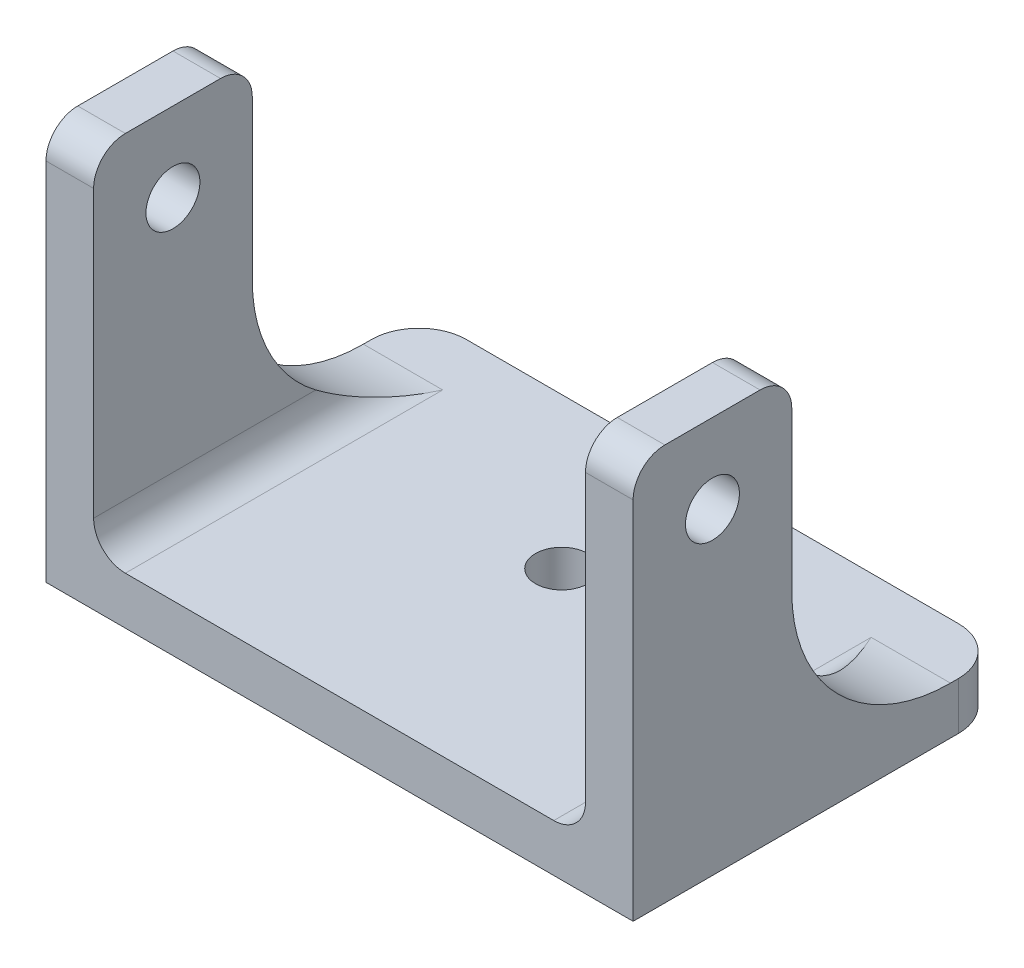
ISO-10303-21;
HEADER;
FILE_DESCRIPTION(('STEP AP214'),'2;1');
FILE_NAME('part.step','',(''),(''),'','','');
FILE_SCHEMA(('AUTOMOTIVE_DESIGN { 1 0 10303 214 1 1 1 1 }'));
ENDSEC;
DATA;
#1=APPLICATION_CONTEXT('core data for automotive mechanical design processes');
#2=APPLICATION_PROTOCOL_DEFINITION('international standard','automotive_design',2000,#1);
#3=PRODUCT_CONTEXT('',#1,'mechanical');
#4=PRODUCT('Part','Part','',(#3));
#5=PRODUCT_RELATED_PRODUCT_CATEGORY('part','',(#4));
#6=PRODUCT_DEFINITION_FORMATION('','',#4);
#7=PRODUCT_DEFINITION_CONTEXT('part definition',#1,'design');
#8=PRODUCT_DEFINITION('design','',#6,#7);
#9=PRODUCT_DEFINITION_SHAPE('','',#8);
#10=(LENGTH_UNIT() NAMED_UNIT(*) SI_UNIT(.MILLI.,.METRE.));
#11=(NAMED_UNIT(*) PLANE_ANGLE_UNIT() SI_UNIT($,.RADIAN.));
#12=(NAMED_UNIT(*) SI_UNIT($,.STERADIAN.) SOLID_ANGLE_UNIT());
#13=UNCERTAINTY_MEASURE_WITH_UNIT(LENGTH_MEASURE(1.E-05),#10,'distance_accuracy_value','');
#14=(GEOMETRIC_REPRESENTATION_CONTEXT(3) GLOBAL_UNCERTAINTY_ASSIGNED_CONTEXT((#13)) GLOBAL_UNIT_ASSIGNED_CONTEXT((#10,
#11,#12)) REPRESENTATION_CONTEXT('',''));
#15=CARTESIAN_POINT('',(0.,0.,0.));
#16=DIRECTION('',(0.,0.,1.));
#17=DIRECTION('',(1.,0.,0.));
#18=AXIS2_PLACEMENT_3D('',#15,#16,#17);
#19=CARTESIAN_POINT('',(0.,3.,0.));
#20=DIRECTION('',(0.,1.,0.));
#21=DIRECTION('',(0.,0.,1.));
#22=AXIS2_PLACEMENT_3D('',#19,#20,#21);
#23=PLANE('',#22);
#24=CARTESIAN_POINT('',(0.,3.,0.));
#25=DIRECTION('',(0.,1.,0.));
#26=DIRECTION('',(0.,0.,1.));
#27=AXIS2_PLACEMENT_3D('',#24,#25,#26);
#28=CIRCLE('',#27,1.65);
#29=CARTESIAN_POINT('',(0.,3.,-1.65));
#30=VERTEX_POINT('',#29);
#31=EDGE_CURVE('E412',#30,#30,#28,.F.);
#32=ORIENTED_EDGE('',*,*,#31,.T.);
#33=EDGE_LOOP('',(#32));
#34=FACE_BOUND('',#33,.T.);
#35=DIRECTION('',(-1.,0.,0.));
#36=VECTOR('',#35,1.);
#37=CARTESIAN_POINT('',(0.,3.,-6.));
#38=LINE('',#37,#36);
#39=CARTESIAN_POINT('',(-18.5,3.,-6.));
#40=VERTEX_POINT('',#39);
#41=CARTESIAN_POINT('',(-13.5,3.,-6.));
#42=VERTEX_POINT('',#41);
#43=EDGE_CURVE('E273',#40,#42,#38,.F.);
#44=ORIENTED_EDGE('',*,*,#43,.T.);
#45=DIRECTION('',(0.,0.,-1.));
#46=VECTOR('',#45,1.);
#47=CARTESIAN_POINT('',(-13.5,3.,0.));
#48=LINE('',#47,#46);
#49=CARTESIAN_POINT('',(-13.5,3.,14.));
#50=VERTEX_POINT('',#49);
#51=EDGE_CURVE('E294',#42,#50,#48,.F.);
#52=ORIENTED_EDGE('',*,*,#51,.T.);
#53=DIRECTION('',(1.,0.,0.));
#54=VECTOR('',#53,1.);
#55=CARTESIAN_POINT('',(-18.5,3.,14.));
#56=LINE('',#55,#54);
#57=CARTESIAN_POINT('',(13.5,3.,14.));
#58=VERTEX_POINT('',#57);
#59=EDGE_CURVE('E421',#50,#58,#56,.T.);
#60=ORIENTED_EDGE('',*,*,#59,.T.);
#61=DIRECTION('',(0.,0.,1.));
#62=VECTOR('',#61,1.);
#63=CARTESIAN_POINT('',(13.5,3.,0.));
#64=LINE('',#63,#62);
#65=CARTESIAN_POINT('',(13.5,3.,-6.));
#66=VERTEX_POINT('',#65);
#67=EDGE_CURVE('E291',#58,#66,#64,.F.);
#68=ORIENTED_EDGE('',*,*,#67,.T.);
#69=DIRECTION('',(-1.,0.,0.));
#70=VECTOR('',#69,1.);
#71=CARTESIAN_POINT('',(0.,3.,-6.));
#72=LINE('',#71,#70);
#73=CARTESIAN_POINT('',(18.5,3.,-6.));
#74=VERTEX_POINT('',#73);
#75=EDGE_CURVE('E275',#66,#74,#72,.F.);
#76=ORIENTED_EDGE('',*,*,#75,.T.);
#77=DIRECTION('',(0.,0.,-1.));
#78=VECTOR('',#77,1.);
#79=CARTESIAN_POINT('',(18.5,3.,-9.5));
#80=LINE('',#79,#78);
#81=CARTESIAN_POINT('',(18.5,3.,-6.5));
#82=VERTEX_POINT('',#81);
#83=EDGE_CURVE('E385',#74,#82,#80,.T.);
#84=ORIENTED_EDGE('',*,*,#83,.T.);
#85=CARTESIAN_POINT('',(15.5,3.,-6.5));
#86=DIRECTION('',(0.,1.,0.));
#87=DIRECTION('',(0.,0.,1.));
#88=AXIS2_PLACEMENT_3D('',#85,#86,#87);
#89=CIRCLE('',#88,3.);
#90=CARTESIAN_POINT('',(15.5,3.,-9.5));
#91=VERTEX_POINT('',#90);
#92=EDGE_CURVE('E223',#82,#91,#89,.T.);
#93=ORIENTED_EDGE('',*,*,#92,.T.);
#94=DIRECTION('',(-1.,0.,0.));
#95=VECTOR('',#94,1.);
#96=CARTESIAN_POINT('',(-18.5,3.,-9.5));
#97=LINE('',#96,#95);
#98=CARTESIAN_POINT('',(-15.5,3.,-9.5));
#99=VERTEX_POINT('',#98);
#100=EDGE_CURVE('E209',#91,#99,#97,.T.);
#101=ORIENTED_EDGE('',*,*,#100,.T.);
#102=CARTESIAN_POINT('',(-15.5,3.,-6.5));
#103=DIRECTION('',(0.,1.,0.));
#104=DIRECTION('',(0.,0.,1.));
#105=AXIS2_PLACEMENT_3D('',#102,#103,#104);
#106=CIRCLE('',#105,3.);
#107=CARTESIAN_POINT('',(-18.5,3.,-6.5));
#108=VERTEX_POINT('',#107);
#109=EDGE_CURVE('E225',#99,#108,#106,.T.);
#110=ORIENTED_EDGE('',*,*,#109,.T.);
#111=DIRECTION('',(0.,0.,1.));
#112=VECTOR('',#111,1.);
#113=CARTESIAN_POINT('',(-18.5,3.,-9.5));
#114=LINE('',#113,#112);
#115=EDGE_CURVE('E208',#108,#40,#114,.T.);
#116=ORIENTED_EDGE('',*,*,#115,.T.);
#117=EDGE_LOOP('',(#44,#52,#60,#68,#76,#84,#93,#101,#110,#116));
#118=FACE_BOUND('',#117,.T.);
#119=ADVANCED_FACE('F32',(#34,#118),#23,.T.);
#120=CARTESIAN_POINT('',(-18.5,3.,-9.5));
#121=DIRECTION('',(1.,0.,0.));
#122=DIRECTION('',(0.,0.,-1.));
#123=AXIS2_PLACEMENT_3D('',#120,#121,#122);
#124=PLANE('',#123);
#125=CARTESIAN_POINT('',(-18.5,20.,9.));
#126=DIRECTION('',(-1.,0.,0.));
#127=DIRECTION('',(0.,0.,1.));
#128=AXIS2_PLACEMENT_3D('',#125,#126,#127);
#129=CIRCLE('',#128,1.7);
#130=CARTESIAN_POINT('',(-18.5,20.,10.7));
#131=VERTEX_POINT('',#130);
#132=EDGE_CURVE('E451',#131,#131,#129,.T.);
#133=ORIENTED_EDGE('',*,*,#132,.F.);
#134=EDGE_LOOP('',(#133));
#135=FACE_BOUND('',#134,.T.);
#136=DIRECTION('',(0.,0.,1.));
#137=VECTOR('',#136,1.);
#138=CARTESIAN_POINT('',(-18.5,25.,14.));
#139=LINE('',#138,#137);
#140=CARTESIAN_POINT('',(-18.5,25.,6.));
#141=VERTEX_POINT('',#140);
#142=CARTESIAN_POINT('',(-18.5,25.,12.));
#143=VERTEX_POINT('',#142);
#144=EDGE_CURVE('E391',#141,#143,#139,.T.);
#145=ORIENTED_EDGE('',*,*,#144,.F.);
#146=CARTESIAN_POINT('',(-18.5,23.,6.));
#147=DIRECTION('',(1.,0.,0.));
#148=DIRECTION('',(0.,0.,-1.));
#149=AXIS2_PLACEMENT_3D('',#146,#147,#148);
#150=CIRCLE('',#149,2.);
#151=CARTESIAN_POINT('',(-18.5,23.,4.));
#152=VERTEX_POINT('',#151);
#153=EDGE_CURVE('E262',#141,#152,#150,.F.);
#154=ORIENTED_EDGE('',*,*,#153,.T.);
#155=DIRECTION('',(0.,-1.,0.));
#156=VECTOR('',#155,1.);
#157=CARTESIAN_POINT('',(-18.5,25.,4.));
#158=LINE('',#157,#156);
#159=CARTESIAN_POINT('',(-18.5,13.,4.));
#160=VERTEX_POINT('',#159);
#161=EDGE_CURVE('E403',#152,#160,#158,.T.);
#162=ORIENTED_EDGE('',*,*,#161,.T.);
#163=CARTESIAN_POINT('',(-18.5,13.,-6.));
#164=DIRECTION('',(1.,0.,0.));
#165=DIRECTION('',(0.,0.,-1.));
#166=AXIS2_PLACEMENT_3D('',#163,#164,#165);
#167=CIRCLE('',#166,10.);
#168=EDGE_CURVE('E284',#160,#40,#167,.T.);
#169=ORIENTED_EDGE('',*,*,#168,.T.);
#170=ORIENTED_EDGE('',*,*,#115,.F.);
#171=DIRECTION('',(0.,-1.,0.));
#172=VECTOR('',#171,1.);
#173=CARTESIAN_POINT('',(-18.5,3.,-6.5));
#174=LINE('',#173,#172);
#175=CARTESIAN_POINT('',(-18.5,0.,-6.5));
#176=VERTEX_POINT('',#175);
#177=EDGE_CURVE('E194',#108,#176,#174,.T.);
#178=ORIENTED_EDGE('',*,*,#177,.T.);
#179=DIRECTION('',(0.,0.,1.));
#180=VECTOR('',#179,1.);
#181=CARTESIAN_POINT('',(-18.5,0.,-9.5));
#182=LINE('',#181,#180);
#183=CARTESIAN_POINT('',(-18.5,0.,14.));
#184=VERTEX_POINT('',#183);
#185=EDGE_CURVE('E189',#176,#184,#182,.T.);
#186=ORIENTED_EDGE('',*,*,#185,.T.);
#187=DIRECTION('',(0.,-1.,0.));
#188=VECTOR('',#187,1.);
#189=CARTESIAN_POINT('',(-18.5,3.,14.));
#190=LINE('',#189,#188);
#191=CARTESIAN_POINT('',(-18.5,23.,14.));
#192=VERTEX_POINT('',#191);
#193=EDGE_CURVE('E172',#192,#184,#190,.T.);
#194=ORIENTED_EDGE('',*,*,#193,.F.);
#195=CARTESIAN_POINT('',(-18.5,23.,12.));
#196=DIRECTION('',(1.,0.,0.));
#197=DIRECTION('',(0.,0.,-1.));
#198=AXIS2_PLACEMENT_3D('',#195,#196,#197);
#199=CIRCLE('',#198,2.);
#200=EDGE_CURVE('E260',#192,#143,#199,.F.);
#201=ORIENTED_EDGE('',*,*,#200,.T.);
#202=EDGE_LOOP('',(#145,#154,#162,#169,#170,#178,#186,#194,#201));
#203=FACE_BOUND('',#202,.T.);
#204=ADVANCED_FACE('F191',(#135,#203),#124,.F.);
#205=CARTESIAN_POINT('',(-18.5,3.,14.));
#206=DIRECTION('',(0.,0.,-1.));
#207=DIRECTION('',(-1.,0.,0.));
#208=AXIS2_PLACEMENT_3D('',#205,#206,#207);
#209=PLANE('',#208);
#210=DIRECTION('',(0.,-1.,0.));
#211=VECTOR('',#210,1.);
#212=CARTESIAN_POINT('',(18.5,3.,14.));
#213=LINE('',#212,#211);
#214=CARTESIAN_POINT('',(18.5,23.,14.));
#215=VERTEX_POINT('',#214);
#216=CARTESIAN_POINT('',(18.5,0.,14.));
#217=VERTEX_POINT('',#216);
#218=EDGE_CURVE('E185',#215,#217,#213,.T.);
#219=ORIENTED_EDGE('',*,*,#218,.F.);
#220=DIRECTION('',(1.,0.,0.));
#221=VECTOR('',#220,1.);
#222=CARTESIAN_POINT('',(15.5,23.,14.));
#223=LINE('',#222,#221);
#224=CARTESIAN_POINT('',(15.5,23.,14.));
#225=VERTEX_POINT('',#224);
#226=EDGE_CURVE('E246',#215,#225,#223,.F.);
#227=ORIENTED_EDGE('',*,*,#226,.T.);
#228=DIRECTION('',(0.,-1.,0.));
#229=VECTOR('',#228,1.);
#230=CARTESIAN_POINT('',(15.5,25.,14.));
#231=LINE('',#230,#229);
#232=CARTESIAN_POINT('',(15.5,5.,14.));
#233=VERTEX_POINT('',#232);
#234=EDGE_CURVE('E397',#225,#233,#231,.T.);
#235=ORIENTED_EDGE('',*,*,#234,.T.);
#236=CARTESIAN_POINT('',(13.5,5.,14.));
#237=DIRECTION('',(0.,0.,-1.));
#238=DIRECTION('',(-1.,0.,0.));
#239=AXIS2_PLACEMENT_3D('',#236,#237,#238);
#240=CIRCLE('',#239,2.);
#241=EDGE_CURVE('E45',#233,#58,#240,.T.);
#242=ORIENTED_EDGE('',*,*,#241,.T.);
#243=ORIENTED_EDGE('',*,*,#59,.F.);
#244=CARTESIAN_POINT('',(-13.5,5.,14.));
#245=DIRECTION('',(0.,0.,-1.));
#246=DIRECTION('',(-1.,0.,0.));
#247=AXIS2_PLACEMENT_3D('',#244,#245,#246);
#248=CIRCLE('',#247,2.);
#249=CARTESIAN_POINT('',(-15.5,5.,14.));
#250=VERTEX_POINT('',#249);
#251=EDGE_CURVE('E305',#50,#250,#248,.T.);
#252=ORIENTED_EDGE('',*,*,#251,.T.);
#253=DIRECTION('',(0.,-1.,0.));
#254=VECTOR('',#253,1.);
#255=CARTESIAN_POINT('',(-15.5,25.,14.));
#256=LINE('',#255,#254);
#257=CARTESIAN_POINT('',(-15.5,23.,14.));
#258=VERTEX_POINT('',#257);
#259=EDGE_CURVE('E409',#258,#250,#256,.T.);
#260=ORIENTED_EDGE('',*,*,#259,.F.);
#261=DIRECTION('',(1.,0.,0.));
#262=VECTOR('',#261,1.);
#263=CARTESIAN_POINT('',(-18.5,23.,14.));
#264=LINE('',#263,#262);
#265=EDGE_CURVE('E181',#258,#192,#264,.F.);
#266=ORIENTED_EDGE('',*,*,#265,.T.);
#267=ORIENTED_EDGE('',*,*,#193,.T.);
#268=DIRECTION('',(1.,0.,0.));
#269=VECTOR('',#268,1.);
#270=CARTESIAN_POINT('',(-18.5,0.,14.));
#271=LINE('',#270,#269);
#272=EDGE_CURVE('E177',#184,#217,#271,.T.);
#273=ORIENTED_EDGE('',*,*,#272,.T.);
#274=EDGE_LOOP('',(#219,#227,#235,#242,#243,#252,#260,#266,#267,#273));
#275=FACE_BOUND('',#274,.T.);
#276=ADVANCED_FACE('F175',(#275),#209,.F.);
#277=CARTESIAN_POINT('',(18.5,3.,-9.5));
#278=DIRECTION('',(-1.,0.,0.));
#279=DIRECTION('',(0.,0.,1.));
#280=AXIS2_PLACEMENT_3D('',#277,#278,#279);
#281=PLANE('',#280);
#282=CARTESIAN_POINT('',(18.5,20.,9.));
#283=DIRECTION('',(-1.,0.,0.));
#284=DIRECTION('',(0.,0.,1.));
#285=AXIS2_PLACEMENT_3D('',#282,#283,#284);
#286=CIRCLE('',#285,1.7);
#287=CARTESIAN_POINT('',(18.5,20.,10.7));
#288=VERTEX_POINT('',#287);
#289=EDGE_CURVE('E235',#288,#288,#286,.T.);
#290=ORIENTED_EDGE('',*,*,#289,.T.);
#291=EDGE_LOOP('',(#290));
#292=FACE_BOUND('',#291,.T.);
#293=DIRECTION('',(0.,0.,-1.));
#294=VECTOR('',#293,1.);
#295=CARTESIAN_POINT('',(18.5,25.,14.));
#296=LINE('',#295,#294);
#297=CARTESIAN_POINT('',(18.5,25.,12.));
#298=VERTEX_POINT('',#297);
#299=CARTESIAN_POINT('',(18.5,25.,6.));
#300=VERTEX_POINT('',#299);
#301=EDGE_CURVE('E445',#298,#300,#296,.T.);
#302=ORIENTED_EDGE('',*,*,#301,.F.);
#303=CARTESIAN_POINT('',(18.5,23.,12.));
#304=DIRECTION('',(-1.,0.,0.));
#305=DIRECTION('',(0.,0.,1.));
#306=AXIS2_PLACEMENT_3D('',#303,#304,#305);
#307=CIRCLE('',#306,2.);
#308=EDGE_CURVE('E243',#298,#215,#307,.F.);
#309=ORIENTED_EDGE('',*,*,#308,.T.);
#310=ORIENTED_EDGE('',*,*,#218,.T.);
#311=DIRECTION('',(0.,0.,-1.));
#312=VECTOR('',#311,1.);
#313=CARTESIAN_POINT('',(18.5,0.,-9.5));
#314=LINE('',#313,#312);
#315=CARTESIAN_POINT('',(18.5,0.,-6.5));
#316=VERTEX_POINT('',#315);
#317=EDGE_CURVE('E200',#217,#316,#314,.T.);
#318=ORIENTED_EDGE('',*,*,#317,.T.);
#319=DIRECTION('',(0.,-1.,0.));
#320=VECTOR('',#319,1.);
#321=CARTESIAN_POINT('',(18.5,3.,-6.5));
#322=LINE('',#321,#320);
#323=EDGE_CURVE('E227',#316,#82,#322,.F.);
#324=ORIENTED_EDGE('',*,*,#323,.T.);
#325=ORIENTED_EDGE('',*,*,#83,.F.);
#326=CARTESIAN_POINT('',(18.5,13.,-6.));
#327=DIRECTION('',(-1.,0.,0.));
#328=DIRECTION('',(0.,0.,1.));
#329=AXIS2_PLACEMENT_3D('',#326,#327,#328);
#330=CIRCLE('',#329,10.);
#331=CARTESIAN_POINT('',(18.5,13.,4.));
#332=VERTEX_POINT('',#331);
#333=EDGE_CURVE('E282',#74,#332,#330,.T.);
#334=ORIENTED_EDGE('',*,*,#333,.T.);
#335=DIRECTION('',(0.,-1.,0.));
#336=VECTOR('',#335,1.);
#337=CARTESIAN_POINT('',(18.5,25.,4.));
#338=LINE('',#337,#336);
#339=CARTESIAN_POINT('',(18.5,23.,4.));
#340=VERTEX_POINT('',#339);
#341=EDGE_CURVE('E383',#340,#332,#338,.T.);
#342=ORIENTED_EDGE('',*,*,#341,.F.);
#343=CARTESIAN_POINT('',(18.5,23.,6.));
#344=DIRECTION('',(-1.,0.,0.));
#345=DIRECTION('',(0.,0.,1.));
#346=AXIS2_PLACEMENT_3D('',#343,#344,#345);
#347=CIRCLE('',#346,2.);
#348=EDGE_CURVE('E241',#340,#300,#347,.F.);
#349=ORIENTED_EDGE('',*,*,#348,.T.);
#350=EDGE_LOOP('',(#302,#309,#310,#318,#324,#325,#334,#342,#349));
#351=FACE_BOUND('',#350,.T.);
#352=ADVANCED_FACE('F339',(#292,#351),#281,.F.);
#353=CARTESIAN_POINT('',(-18.5,3.,-9.5));
#354=DIRECTION('',(0.,0.,1.));
#355=DIRECTION('',(1.,0.,0.));
#356=AXIS2_PLACEMENT_3D('',#353,#354,#355);
#357=PLANE('',#356);
#358=DIRECTION('',(-1.,0.,0.));
#359=VECTOR('',#358,1.);
#360=CARTESIAN_POINT('',(-18.5,0.,-9.5));
#361=LINE('',#360,#359);
#362=CARTESIAN_POINT('',(15.5,0.,-9.5));
#363=VERTEX_POINT('',#362);
#364=CARTESIAN_POINT('',(-15.5,0.,-9.5));
#365=VERTEX_POINT('',#364);
#366=EDGE_CURVE('E202',#363,#365,#361,.T.);
#367=ORIENTED_EDGE('',*,*,#366,.T.);
#368=DIRECTION('',(0.,-1.,0.));
#369=VECTOR('',#368,1.);
#370=CARTESIAN_POINT('',(-15.5,3.,-9.5));
#371=LINE('',#370,#369);
#372=EDGE_CURVE('E221',#365,#99,#371,.F.);
#373=ORIENTED_EDGE('',*,*,#372,.T.);
#374=ORIENTED_EDGE('',*,*,#100,.F.);
#375=DIRECTION('',(0.,-1.,0.));
#376=VECTOR('',#375,1.);
#377=CARTESIAN_POINT('',(15.5,3.,-9.5));
#378=LINE('',#377,#376);
#379=EDGE_CURVE('E218',#91,#363,#378,.T.);
#380=ORIENTED_EDGE('',*,*,#379,.T.);
#381=EDGE_LOOP('',(#367,#373,#374,#380));
#382=FACE_BOUND('',#381,.T.);
#383=ADVANCED_FACE('F335',(#382),#357,.F.);
#384=CARTESIAN_POINT('',(0.,0.,0.));
#385=DIRECTION('',(0.,1.,0.));
#386=DIRECTION('',(0.,0.,1.));
#387=AXIS2_PLACEMENT_3D('',#384,#385,#386);
#388=PLANE('',#387);
#389=CARTESIAN_POINT('',(0.,0.,0.));
#390=DIRECTION('',(0.,1.,0.));
#391=DIRECTION('',(0.,0.,1.));
#392=AXIS2_PLACEMENT_3D('',#389,#390,#391);
#393=CIRCLE('',#392,7.);
#394=CARTESIAN_POINT('',(0.,0.,7.));
#395=VERTEX_POINT('',#394);
#396=EDGE_CURVE('E184',#395,#395,#393,.F.);
#397=ORIENTED_EDGE('',*,*,#396,.F.);
#398=EDGE_LOOP('',(#397));
#399=FACE_BOUND('',#398,.T.);
#400=ORIENTED_EDGE('',*,*,#185,.F.);
#401=CARTESIAN_POINT('',(-15.5,0.,-6.5));
#402=DIRECTION('',(0.,1.,0.));
#403=DIRECTION('',(0.,0.,1.));
#404=AXIS2_PLACEMENT_3D('',#401,#402,#403);
#405=CIRCLE('',#404,3.);
#406=EDGE_CURVE('E216',#176,#365,#405,.F.);
#407=ORIENTED_EDGE('',*,*,#406,.T.);
#408=ORIENTED_EDGE('',*,*,#366,.F.);
#409=CARTESIAN_POINT('',(15.5,0.,-6.5));
#410=DIRECTION('',(0.,1.,0.));
#411=DIRECTION('',(0.,0.,1.));
#412=AXIS2_PLACEMENT_3D('',#409,#410,#411);
#413=CIRCLE('',#412,3.);
#414=EDGE_CURVE('E214',#363,#316,#413,.F.);
#415=ORIENTED_EDGE('',*,*,#414,.T.);
#416=ORIENTED_EDGE('',*,*,#317,.F.);
#417=ORIENTED_EDGE('',*,*,#272,.F.);
#418=EDGE_LOOP('',(#400,#407,#408,#415,#416,#417));
#419=FACE_BOUND('',#418,.T.);
#420=ADVANCED_FACE('F198',(#399,#419),#388,.F.);
#421=CARTESIAN_POINT('',(0.,-3.,0.));
#422=DIRECTION('',(0.,1.,0.));
#423=DIRECTION('',(0.,0.,1.));
#424=AXIS2_PLACEMENT_3D('',#421,#422,#423);
#425=CYLINDRICAL_SURFACE('',#424,7.);
#426=CARTESIAN_POINT('',(0.,-3.,0.));
#427=DIRECTION('',(0.,-1.,0.));
#428=DIRECTION('',(0.,0.,-1.));
#429=AXIS2_PLACEMENT_3D('',#426,#427,#428);
#430=CIRCLE('',#429,7.);
#431=CARTESIAN_POINT('',(0.,-3.,-7.));
#432=VERTEX_POINT('',#431);
#433=EDGE_CURVE('E196',#432,#432,#430,.T.);
#434=ORIENTED_EDGE('',*,*,#433,.F.);
#435=EDGE_LOOP('',(#434));
#436=FACE_BOUND('',#435,.T.);
#437=ORIENTED_EDGE('',*,*,#396,.T.);
#438=EDGE_LOOP('',(#437));
#439=FACE_BOUND('',#438,.T.);
#440=ADVANCED_FACE('F331',(#436,#439),#425,.T.);
#441=CARTESIAN_POINT('',(0.,-3.,0.));
#442=DIRECTION('',(0.,-1.,0.));
#443=DIRECTION('',(0.,0.,-1.));
#444=AXIS2_PLACEMENT_3D('',#441,#442,#443);
#445=PLANE('',#444);
#446=CARTESIAN_POINT('',(0.,-3.,0.));
#447=DIRECTION('',(0.,-1.,0.));
#448=DIRECTION('',(0.,0.,-1.));
#449=AXIS2_PLACEMENT_3D('',#446,#447,#448);
#450=CIRCLE('',#449,1.65);
#451=CARTESIAN_POINT('',(0.,-3.,-1.65));
#452=VERTEX_POINT('',#451);
#453=EDGE_CURVE('E413',#452,#452,#450,.T.);
#454=ORIENTED_EDGE('',*,*,#453,.F.);
#455=EDGE_LOOP('',(#454));
#456=FACE_BOUND('',#455,.T.);
#457=ORIENTED_EDGE('',*,*,#433,.T.);
#458=EDGE_LOOP('',(#457));
#459=FACE_BOUND('',#458,.T.);
#460=ADVANCED_FACE('F485',(#456,#459),#445,.T.);
#461=CARTESIAN_POINT('',(0.,3.001,0.));
#462=DIRECTION('',(0.,-1.,0.));
#463=DIRECTION('',(0.,0.,-1.));
#464=AXIS2_PLACEMENT_3D('',#461,#462,#463);
#465=CYLINDRICAL_SURFACE('',#464,1.65);
#466=CARTESIAN_POINT('',(0.,3.,-1.65));
#467=CARTESIAN_POINT('',(0.,2.9375,-1.65));
#468=CARTESIAN_POINT('',(0.,2.875,-1.65));
#469=CARTESIAN_POINT('',(0.,2.75,-1.65));
#470=CARTESIAN_POINT('',(0.,2.6875,-1.65));
#471=CARTESIAN_POINT('',(0.,2.5625,-1.65));
#472=CARTESIAN_POINT('',(0.,2.5,-1.65));
#473=CARTESIAN_POINT('',(0.,2.375,-1.65));
#474=CARTESIAN_POINT('',(0.,2.3125,-1.65));
#475=CARTESIAN_POINT('',(0.,2.1875,-1.65));
#476=CARTESIAN_POINT('',(0.,2.125,-1.65));
#477=CARTESIAN_POINT('',(0.,2.,-1.65));
#478=CARTESIAN_POINT('',(0.,1.9375,-1.65));
#479=CARTESIAN_POINT('',(0.,1.8125,-1.65));
#480=CARTESIAN_POINT('',(0.,1.75,-1.65));
#481=CARTESIAN_POINT('',(0.,1.625,-1.65));
#482=CARTESIAN_POINT('',(0.,1.5625,-1.65));
#483=CARTESIAN_POINT('',(0.,1.4375,-1.65));
#484=CARTESIAN_POINT('',(0.,1.375,-1.65));
#485=CARTESIAN_POINT('',(0.,1.25,-1.65));
#486=CARTESIAN_POINT('',(0.,1.1875,-1.65));
#487=CARTESIAN_POINT('',(0.,1.0625,-1.65));
#488=CARTESIAN_POINT('',(0.,1.,-1.65));
#489=CARTESIAN_POINT('',(0.,0.875,-1.65));
#490=CARTESIAN_POINT('',(0.,0.8125,-1.65));
#491=CARTESIAN_POINT('',(0.,0.6875,-1.65));
#492=CARTESIAN_POINT('',(0.,0.625,-1.65));
#493=CARTESIAN_POINT('',(0.,0.5,-1.65));
#494=CARTESIAN_POINT('',(0.,0.4375,-1.65));
#495=CARTESIAN_POINT('',(0.,0.3125,-1.65));
#496=CARTESIAN_POINT('',(0.,0.25,-1.65));
#497=CARTESIAN_POINT('',(0.,0.125,-1.65));
#498=CARTESIAN_POINT('',(0.,0.0624999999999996,-1.65));
#499=CARTESIAN_POINT('',(0.,-0.0625000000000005,-1.65));
#500=CARTESIAN_POINT('',(0.,-0.125000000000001,-1.65));
#501=CARTESIAN_POINT('',(0.,-0.250000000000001,-1.65));
#502=CARTESIAN_POINT('',(0.,-0.3125,-1.65));
#503=CARTESIAN_POINT('',(0.,-0.4375,-1.65));
#504=CARTESIAN_POINT('',(0.,-0.5,-1.65));
#505=CARTESIAN_POINT('',(0.,-0.625000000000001,-1.65));
#506=CARTESIAN_POINT('',(0.,-0.687500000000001,-1.65));
#507=CARTESIAN_POINT('',(0.,-0.8125,-1.65));
#508=CARTESIAN_POINT('',(0.,-0.875,-1.65));
#509=CARTESIAN_POINT('',(0.,-1.,-1.65));
#510=CARTESIAN_POINT('',(0.,-1.0625,-1.65));
#511=CARTESIAN_POINT('',(0.,-1.1875,-1.65));
#512=CARTESIAN_POINT('',(0.,-1.25,-1.65));
#513=CARTESIAN_POINT('',(0.,-1.375,-1.65));
#514=CARTESIAN_POINT('',(0.,-1.4375,-1.65));
#515=CARTESIAN_POINT('',(0.,-1.5625,-1.65));
#516=CARTESIAN_POINT('',(0.,-1.625,-1.65));
#517=CARTESIAN_POINT('',(0.,-1.75,-1.65));
#518=CARTESIAN_POINT('',(0.,-1.8125,-1.65));
#519=CARTESIAN_POINT('',(0.,-1.9375,-1.65));
#520=CARTESIAN_POINT('',(0.,-2.,-1.65));
#521=CARTESIAN_POINT('',(0.,-2.125,-1.65));
#522=CARTESIAN_POINT('',(0.,-2.1875,-1.65));
#523=CARTESIAN_POINT('',(0.,-2.3125,-1.65));
#524=CARTESIAN_POINT('',(0.,-2.375,-1.65));
#525=CARTESIAN_POINT('',(0.,-2.5,-1.65));
#526=CARTESIAN_POINT('',(0.,-2.5625,-1.65));
#527=CARTESIAN_POINT('',(0.,-2.6875,-1.65));
#528=CARTESIAN_POINT('',(0.,-2.75,-1.65));
#529=CARTESIAN_POINT('',(0.,-2.875,-1.65));
#530=CARTESIAN_POINT('',(0.,-2.9375,-1.65));
#531=CARTESIAN_POINT('',(0.,-3.,-1.65));
#532=B_SPLINE_CURVE_WITH_KNOTS('',3,(#466,#467,#468,#469,#470,#471,#472,#473,#474,#475,#476,
#477,#478,#479,#480,#481,#482,#483,#484,#485,#486,#487,#488,#489,#490,#491,#492,#493,#494,#495,
#496,#497,#498,#499,#500,#501,#502,#503,#504,#505,#506,#507,#508,#509,#510,#511,#512,#513,#514,
#515,#516,#517,#518,#519,#520,#521,#522,#523,#524,#525,#526,#527,#528,#529,#530,#531),
.UNSPECIFIED.,.F.,.F.,(4,2,2,2,2,2,2,2,2,2,2,2,2,2,2,2,2,2,2,2,2,2,2,2,2,2,2,2,2,2,2,2,4),(0.,
0.1875,0.375,0.5625,0.75,0.9375,1.125,1.3125,1.5,1.6875,1.875,2.0625,2.25,2.4375,2.625,2.8125,
3.,3.1875,3.375,3.5625,3.75,3.9375,4.125,4.3125,4.5,4.6875,4.875,5.0625,5.25,5.4375,5.625,
5.8125,6.),.UNSPECIFIED.);
#533=EDGE_CURVE('BSEAM482',#30,#452,#532,.T.);
#534=ORIENTED_EDGE('',*,*,#31,.F.);
#535=ORIENTED_EDGE('',*,*,#453,.T.);
#536=ORIENTED_EDGE('',*,*,#533,.T.);
#537=ORIENTED_EDGE('',*,*,#533,.F.);
#538=EDGE_LOOP('',(#534,#536,#535,#537));
#539=FACE_BOUND('',#538,.T.);
#540=ADVANCED_FACE('F482',(#539),#465,.F.);
#541=CARTESIAN_POINT('',(-15.5,25.,14.));
#542=DIRECTION('',(-1.,0.,0.));
#543=DIRECTION('',(0.,0.,1.));
#544=AXIS2_PLACEMENT_3D('',#541,#542,#543);
#545=PLANE('',#544);
#546=CARTESIAN_POINT('',(-15.5,20.,9.));
#547=DIRECTION('',(-1.,0.,0.));
#548=DIRECTION('',(0.,0.,1.));
#549=AXIS2_PLACEMENT_3D('',#546,#547,#548);
#550=CIRCLE('',#549,1.7);
#551=CARTESIAN_POINT('',(-15.5,20.,10.7));
#552=VERTEX_POINT('',#551);
#553=EDGE_CURVE('E234',#552,#552,#550,.T.);
#554=ORIENTED_EDGE('',*,*,#553,.T.);
#555=EDGE_LOOP('',(#554));
#556=FACE_BOUND('',#555,.T.);
#557=ORIENTED_EDGE('',*,*,#259,.T.);
#558=DIRECTION('',(0.,0.,-1.));
#559=VECTOR('',#558,1.);
#560=CARTESIAN_POINT('',(-15.5,5.,14.));
#561=LINE('',#560,#559);
#562=CARTESIAN_POINT('',(-15.5,5.,0.));
#563=VERTEX_POINT('',#562);
#564=EDGE_CURVE('E288',#250,#563,#561,.T.);
#565=ORIENTED_EDGE('',*,*,#564,.T.);
#566=CARTESIAN_POINT('',(-15.5,13.,-6.));
#567=DIRECTION('',(-1.,0.,0.));
#568=DIRECTION('',(0.,0.,1.));
#569=AXIS2_PLACEMENT_3D('',#566,#567,#568);
#570=CIRCLE('',#569,10.);
#571=CARTESIAN_POINT('',(-15.5,13.,4.));
#572=VERTEX_POINT('',#571);
#573=EDGE_CURVE('E286',#563,#572,#570,.T.);
#574=ORIENTED_EDGE('',*,*,#573,.T.);
#575=DIRECTION('',(0.,-1.,0.));
#576=VECTOR('',#575,1.);
#577=CARTESIAN_POINT('',(-15.5,25.,4.));
#578=LINE('',#577,#576);
#579=CARTESIAN_POINT('',(-15.5,23.,4.));
#580=VERTEX_POINT('',#579);
#581=EDGE_CURVE('E406',#580,#572,#578,.T.);
#582=ORIENTED_EDGE('',*,*,#581,.F.);
#583=CARTESIAN_POINT('',(-15.5,23.,6.));
#584=DIRECTION('',(-1.,0.,0.));
#585=DIRECTION('',(0.,0.,1.));
#586=AXIS2_PLACEMENT_3D('',#583,#584,#585);
#587=CIRCLE('',#586,2.);
#588=CARTESIAN_POINT('',(-15.5,25.,6.));
#589=VERTEX_POINT('',#588);
#590=EDGE_CURVE('E268',#580,#589,#587,.F.);
#591=ORIENTED_EDGE('',*,*,#590,.T.);
#592=DIRECTION('',(0.,0.,-1.));
#593=VECTOR('',#592,1.);
#594=CARTESIAN_POINT('',(-15.5,25.,14.));
#595=LINE('',#594,#593);
#596=CARTESIAN_POINT('',(-15.5,25.,12.));
#597=VERTEX_POINT('',#596);
#598=EDGE_CURVE('E395',#597,#589,#595,.T.);
#599=ORIENTED_EDGE('',*,*,#598,.F.);
#600=CARTESIAN_POINT('',(-15.5,23.,12.));
#601=DIRECTION('',(-1.,0.,0.));
#602=DIRECTION('',(0.,0.,1.));
#603=AXIS2_PLACEMENT_3D('',#600,#601,#602);
#604=CIRCLE('',#603,2.);
#605=EDGE_CURVE('E266',#597,#258,#604,.F.);
#606=ORIENTED_EDGE('',*,*,#605,.T.);
#607=EDGE_LOOP('',(#557,#565,#574,#582,#591,#599,#606));
#608=FACE_BOUND('',#607,.T.);
#609=ADVANCED_FACE('F478',(#556,#608),#545,.F.);
#610=CARTESIAN_POINT('',(-18.5,25.,4.));
#611=DIRECTION('',(0.,0.,1.));
#612=DIRECTION('',(1.,0.,0.));
#613=AXIS2_PLACEMENT_3D('',#610,#611,#612);
#614=PLANE('',#613);
#615=ORIENTED_EDGE('',*,*,#581,.T.);
#616=DIRECTION('',(-1.,0.,0.));
#617=VECTOR('',#616,1.);
#618=CARTESIAN_POINT('',(-18.5,13.,4.));
#619=LINE('',#618,#617);
#620=EDGE_CURVE('E277',#572,#160,#619,.T.);
#621=ORIENTED_EDGE('',*,*,#620,.T.);
#622=ORIENTED_EDGE('',*,*,#161,.F.);
#623=DIRECTION('',(-1.,0.,0.));
#624=VECTOR('',#623,1.);
#625=CARTESIAN_POINT('',(-18.5,23.,4.));
#626=LINE('',#625,#624);
#627=EDGE_CURVE('E264',#152,#580,#626,.F.);
#628=ORIENTED_EDGE('',*,*,#627,.T.);
#629=EDGE_LOOP('',(#615,#621,#622,#628));
#630=FACE_BOUND('',#629,.T.);
#631=ADVANCED_FACE('F474',(#630),#614,.F.);
#632=CARTESIAN_POINT('',(0.,25.,0.));
#633=DIRECTION('',(0.,-1.,0.));
#634=DIRECTION('',(0.,0.,-1.));
#635=AXIS2_PLACEMENT_3D('',#632,#633,#634);
#636=PLANE('',#635);
#637=ORIENTED_EDGE('',*,*,#598,.T.);
#638=DIRECTION('',(-1.,0.,0.));
#639=VECTOR('',#638,1.);
#640=CARTESIAN_POINT('',(0.,25.,6.));
#641=LINE('',#640,#639);
#642=EDGE_CURVE('E257',#589,#141,#641,.T.);
#643=ORIENTED_EDGE('',*,*,#642,.T.);
#644=ORIENTED_EDGE('',*,*,#144,.T.);
#645=DIRECTION('',(1.,0.,0.));
#646=VECTOR('',#645,1.);
#647=CARTESIAN_POINT('',(0.,25.,12.));
#648=LINE('',#647,#646);
#649=EDGE_CURVE('E254',#143,#597,#648,.T.);
#650=ORIENTED_EDGE('',*,*,#649,.T.);
#651=EDGE_LOOP('',(#637,#643,#644,#650));
#652=FACE_BOUND('',#651,.T.);
#653=ADVANCED_FACE('F469',(#652),#636,.F.);
#654=CARTESIAN_POINT('',(18.5,25.,4.));
#655=DIRECTION('',(0.,0.,1.));
#656=DIRECTION('',(1.,0.,0.));
#657=AXIS2_PLACEMENT_3D('',#654,#655,#656);
#658=PLANE('',#657);
#659=ORIENTED_EDGE('',*,*,#341,.T.);
#660=DIRECTION('',(-1.,0.,0.));
#661=VECTOR('',#660,1.);
#662=CARTESIAN_POINT('',(18.5,13.,4.));
#663=LINE('',#662,#661);
#664=CARTESIAN_POINT('',(15.5,13.,4.));
#665=VERTEX_POINT('',#664);
#666=EDGE_CURVE('E270',#332,#665,#663,.T.);
#667=ORIENTED_EDGE('',*,*,#666,.T.);
#668=DIRECTION('',(0.,-1.,0.));
#669=VECTOR('',#668,1.);
#670=CARTESIAN_POINT('',(15.5,25.,4.));
#671=LINE('',#670,#669);
#672=CARTESIAN_POINT('',(15.5,23.,4.));
#673=VERTEX_POINT('',#672);
#674=EDGE_CURVE('E392',#673,#665,#671,.T.);
#675=ORIENTED_EDGE('',*,*,#674,.F.);
#676=DIRECTION('',(-1.,0.,0.));
#677=VECTOR('',#676,1.);
#678=CARTESIAN_POINT('',(18.5,23.,4.));
#679=LINE('',#678,#677);
#680=EDGE_CURVE('E252',#673,#340,#679,.F.);
#681=ORIENTED_EDGE('',*,*,#680,.T.);
#682=EDGE_LOOP('',(#659,#667,#675,#681));
#683=FACE_BOUND('',#682,.T.);
#684=ADVANCED_FACE('F387',(#683),#658,.F.);
#685=CARTESIAN_POINT('',(15.5,25.,14.));
#686=DIRECTION('',(1.,0.,0.));
#687=DIRECTION('',(0.,0.,-1.));
#688=AXIS2_PLACEMENT_3D('',#685,#686,#687);
#689=PLANE('',#688);
#690=CARTESIAN_POINT('',(15.5,20.,9.));
#691=DIRECTION('',(1.,0.,0.));
#692=DIRECTION('',(0.,0.,-1.));
#693=AXIS2_PLACEMENT_3D('',#690,#691,#692);
#694=CIRCLE('',#693,1.7);
#695=CARTESIAN_POINT('',(15.5,20.,7.3));
#696=VERTEX_POINT('',#695);
#697=EDGE_CURVE('E231',#696,#696,#694,.T.);
#698=ORIENTED_EDGE('',*,*,#697,.T.);
#699=EDGE_LOOP('',(#698));
#700=FACE_BOUND('',#699,.T.);
#701=CARTESIAN_POINT('',(15.5,13.,-6.));
#702=DIRECTION('',(1.,0.,0.));
#703=DIRECTION('',(0.,0.,-1.));
#704=AXIS2_PLACEMENT_3D('',#701,#702,#703);
#705=CIRCLE('',#704,10.);
#706=CARTESIAN_POINT('',(15.5,5.,0.));
#707=VERTEX_POINT('',#706);
#708=EDGE_CURVE('E280',#665,#707,#705,.T.);
#709=ORIENTED_EDGE('',*,*,#708,.T.);
#710=DIRECTION('',(0.,0.,1.));
#711=VECTOR('',#710,1.);
#712=CARTESIAN_POINT('',(15.5,5.,14.));
#713=LINE('',#712,#711);
#714=EDGE_CURVE('E296',#707,#233,#713,.T.);
#715=ORIENTED_EDGE('',*,*,#714,.T.);
#716=ORIENTED_EDGE('',*,*,#234,.F.);
#717=CARTESIAN_POINT('',(15.5,23.,12.));
#718=DIRECTION('',(1.,0.,0.));
#719=DIRECTION('',(0.,0.,-1.));
#720=AXIS2_PLACEMENT_3D('',#717,#718,#719);
#721=CIRCLE('',#720,2.);
#722=CARTESIAN_POINT('',(15.5,25.,12.));
#723=VERTEX_POINT('',#722);
#724=EDGE_CURVE('E250',#225,#723,#721,.F.);
#725=ORIENTED_EDGE('',*,*,#724,.T.);
#726=DIRECTION('',(0.,0.,1.));
#727=VECTOR('',#726,1.);
#728=CARTESIAN_POINT('',(15.5,25.,14.));
#729=LINE('',#728,#727);
#730=CARTESIAN_POINT('',(15.5,25.,6.));
#731=VERTEX_POINT('',#730);
#732=EDGE_CURVE('E441',#731,#723,#729,.T.);
#733=ORIENTED_EDGE('',*,*,#732,.F.);
#734=CARTESIAN_POINT('',(15.5,23.,6.));
#735=DIRECTION('',(1.,0.,0.));
#736=DIRECTION('',(0.,0.,-1.));
#737=AXIS2_PLACEMENT_3D('',#734,#735,#736);
#738=CIRCLE('',#737,2.);
#739=EDGE_CURVE('E248',#731,#673,#738,.F.);
#740=ORIENTED_EDGE('',*,*,#739,.T.);
#741=ORIENTED_EDGE('',*,*,#674,.T.);
#742=EDGE_LOOP('',(#709,#715,#716,#725,#733,#740,#741));
#743=FACE_BOUND('',#742,.T.);
#744=ADVANCED_FACE('F440',(#700,#743),#689,.F.);
#745=CARTESIAN_POINT('',(0.,25.,0.));
#746=DIRECTION('',(0.,1.,0.));
#747=DIRECTION('',(0.,0.,1.));
#748=AXIS2_PLACEMENT_3D('',#745,#746,#747);
#749=PLANE('',#748);
#750=ORIENTED_EDGE('',*,*,#732,.T.);
#751=DIRECTION('',(1.,0.,0.));
#752=VECTOR('',#751,1.);
#753=CARTESIAN_POINT('',(18.5,25.,12.));
#754=LINE('',#753,#752);
#755=EDGE_CURVE('E238',#723,#298,#754,.T.);
#756=ORIENTED_EDGE('',*,*,#755,.T.);
#757=ORIENTED_EDGE('',*,*,#301,.T.);
#758=DIRECTION('',(-1.,0.,0.));
#759=VECTOR('',#758,1.);
#760=CARTESIAN_POINT('',(15.5,25.,6.));
#761=LINE('',#760,#759);
#762=EDGE_CURVE('E230',#300,#731,#761,.T.);
#763=ORIENTED_EDGE('',*,*,#762,.T.);
#764=EDGE_LOOP('',(#750,#756,#757,#763));
#765=FACE_BOUND('',#764,.T.);
#766=ADVANCED_FACE('F350',(#765),#749,.T.);
#767=CARTESIAN_POINT('',(-15.5,3.,-6.5));
#768=DIRECTION('',(0.,-1.,0.));
#769=DIRECTION('',(0.,0.,-1.));
#770=AXIS2_PLACEMENT_3D('',#767,#768,#769);
#771=CYLINDRICAL_SURFACE('',#770,3.);
#772=ORIENTED_EDGE('',*,*,#109,.F.);
#773=ORIENTED_EDGE('',*,*,#372,.F.);
#774=ORIENTED_EDGE('',*,*,#406,.F.);
#775=ORIENTED_EDGE('',*,*,#177,.F.);
#776=EDGE_LOOP('',(#772,#773,#774,#775));
#777=FACE_BOUND('',#776,.T.);
#778=ADVANCED_FACE('F346',(#777),#771,.T.);
#779=CARTESIAN_POINT('',(15.5,3.,-6.5));
#780=DIRECTION('',(0.,-1.,0.));
#781=DIRECTION('',(0.,0.,-1.));
#782=AXIS2_PLACEMENT_3D('',#779,#780,#781);
#783=CYLINDRICAL_SURFACE('',#782,3.);
#784=ORIENTED_EDGE('',*,*,#92,.F.);
#785=ORIENTED_EDGE('',*,*,#323,.F.);
#786=ORIENTED_EDGE('',*,*,#414,.F.);
#787=ORIENTED_EDGE('',*,*,#379,.F.);
#788=EDGE_LOOP('',(#784,#785,#786,#787));
#789=FACE_BOUND('',#788,.T.);
#790=ADVANCED_FACE('F349',(#789),#783,.T.);
#791=CARTESIAN_POINT('',(18.5,20.,9.));
#792=DIRECTION('',(-1.,0.,0.));
#793=DIRECTION('',(0.,0.,1.));
#794=AXIS2_PLACEMENT_3D('',#791,#792,#793);
#795=CYLINDRICAL_SURFACE('',#794,1.7);
#796=ORIENTED_EDGE('',*,*,#289,.F.);
#797=EDGE_LOOP('',(#796));
#798=FACE_BOUND('',#797,.T.);
#799=ORIENTED_EDGE('',*,*,#697,.F.);
#800=EDGE_LOOP('',(#799));
#801=FACE_BOUND('',#800,.T.);
#802=ADVANCED_FACE('F354',(#798,#801),#795,.F.);
#803=ORIENTED_EDGE('',*,*,#132,.T.);
#804=EDGE_LOOP('',(#803));
#805=FACE_BOUND('',#804,.T.);
#806=ORIENTED_EDGE('',*,*,#553,.F.);
#807=EDGE_LOOP('',(#806));
#808=FACE_BOUND('',#807,.T.);
#809=ADVANCED_FACE('F360',(#805,#808),#795,.F.);
#810=CARTESIAN_POINT('',(0.,23.,12.));
#811=DIRECTION('',(-1.,0.,0.));
#812=DIRECTION('',(0.,0.,1.));
#813=AXIS2_PLACEMENT_3D('',#810,#811,#812);
#814=CYLINDRICAL_SURFACE('',#813,2.);
#815=ORIENTED_EDGE('',*,*,#724,.F.);
#816=ORIENTED_EDGE('',*,*,#226,.F.);
#817=ORIENTED_EDGE('',*,*,#308,.F.);
#818=ORIENTED_EDGE('',*,*,#755,.F.);
#819=EDGE_LOOP('',(#815,#816,#817,#818));
#820=FACE_BOUND('',#819,.T.);
#821=ADVANCED_FACE('F356',(#820),#814,.T.);
#822=CARTESIAN_POINT('',(0.,23.,6.));
#823=DIRECTION('',(1.,0.,0.));
#824=DIRECTION('',(0.,0.,-1.));
#825=AXIS2_PLACEMENT_3D('',#822,#823,#824);
#826=CYLINDRICAL_SURFACE('',#825,2.);
#827=ORIENTED_EDGE('',*,*,#348,.F.);
#828=ORIENTED_EDGE('',*,*,#680,.F.);
#829=ORIENTED_EDGE('',*,*,#739,.F.);
#830=ORIENTED_EDGE('',*,*,#762,.F.);
#831=EDGE_LOOP('',(#827,#828,#829,#830));
#832=FACE_BOUND('',#831,.T.);
#833=ADVANCED_FACE('F359',(#832),#826,.T.);
#834=CARTESIAN_POINT('',(0.,23.,6.));
#835=DIRECTION('',(-1.,0.,0.));
#836=DIRECTION('',(0.,0.,1.));
#837=AXIS2_PLACEMENT_3D('',#834,#835,#836);
#838=CYLINDRICAL_SURFACE('',#837,2.);
#839=ORIENTED_EDGE('',*,*,#590,.F.);
#840=ORIENTED_EDGE('',*,*,#627,.F.);
#841=ORIENTED_EDGE('',*,*,#153,.F.);
#842=ORIENTED_EDGE('',*,*,#642,.F.);
#843=EDGE_LOOP('',(#839,#840,#841,#842));
#844=FACE_BOUND('',#843,.T.);
#845=ADVANCED_FACE('F364',(#844),#838,.T.);
#846=CARTESIAN_POINT('',(0.,23.,12.));
#847=DIRECTION('',(1.,0.,0.));
#848=DIRECTION('',(0.,0.,-1.));
#849=AXIS2_PLACEMENT_3D('',#846,#847,#848);
#850=CYLINDRICAL_SURFACE('',#849,2.);
#851=ORIENTED_EDGE('',*,*,#200,.F.);
#852=ORIENTED_EDGE('',*,*,#265,.F.);
#853=ORIENTED_EDGE('',*,*,#605,.F.);
#854=ORIENTED_EDGE('',*,*,#649,.F.);
#855=EDGE_LOOP('',(#851,#852,#853,#854));
#856=FACE_BOUND('',#855,.T.);
#857=ADVANCED_FACE('F368',(#856),#850,.T.);
#858=CARTESIAN_POINT('',(18.5,13.,-6.));
#859=DIRECTION('',(-1.,0.,0.));
#860=DIRECTION('',(0.,0.,1.));
#861=AXIS2_PLACEMENT_3D('',#858,#859,#860);
#862=CYLINDRICAL_SURFACE('',#861,10.);
#863=ORIENTED_EDGE('',*,*,#333,.F.);
#864=ORIENTED_EDGE('',*,*,#75,.F.);
#865=CARTESIAN_POINT('',(15.5,5.,0.));
#866=CARTESIAN_POINT('',(15.4999954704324,4.95271371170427,-0.0630463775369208));
#867=CARTESIAN_POINT('',(15.4983236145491,4.90618652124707,-0.126637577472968));
#868=CARTESIAN_POINT('',(15.4919285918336,4.81473046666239,-0.254780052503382));
#869=CARTESIAN_POINT('',(15.4872063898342,4.76980110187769,-0.319331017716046));
#870=CARTESIAN_POINT('',(15.4689117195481,4.63766217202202,-0.514029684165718));
#871=CARTESIAN_POINT('',(15.4512088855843,4.55291214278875,-0.645476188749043));
#872=CARTESIAN_POINT('',(15.4068252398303,4.3908809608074,-0.910108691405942));
#873=CARTESIAN_POINT('',(15.3802060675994,4.31355309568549,-1.04327687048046));
#874=CARTESIAN_POINT('',(15.3194524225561,4.16574737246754,-1.31177170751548));
#875=CARTESIAN_POINT('',(15.2853130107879,4.09527406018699,-1.44709972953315));
#876=CARTESIAN_POINT('',(15.1870630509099,3.91852289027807,-1.80613933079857));
#877=CARTESIAN_POINT('',(15.1177082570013,3.81801206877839,-2.03127255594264));
#878=CARTESIAN_POINT('',(14.966620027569,3.63504485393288,-2.48468424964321));
#879=CARTESIAN_POINT('',(14.884881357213,3.55259613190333,-2.71296401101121));
#880=CARTESIAN_POINT('',(14.7119794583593,3.40498475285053,-3.17260428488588));
#881=CARTESIAN_POINT('',(14.6207807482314,3.33989070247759,-3.40397333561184));
#882=CARTESIAN_POINT('',(14.4319051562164,3.22696488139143,-3.86814150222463));
#883=CARTESIAN_POINT('',(14.3342303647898,3.17912757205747,-4.10094013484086));
#884=CARTESIAN_POINT('',(14.1171555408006,3.09342955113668,-4.60820812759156));
#885=CARTESIAN_POINT('',(13.9969369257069,3.05876263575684,-4.88286585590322));
#886=CARTESIAN_POINT('',(13.7538571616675,3.01233060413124,-5.43229712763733));
#887=CARTESIAN_POINT('',(13.6310020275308,3.00051801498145,-5.70706924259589));
#888=CARTESIAN_POINT('',(13.5054432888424,3.00000555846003,-5.98782843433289));
#889=CARTESIAN_POINT('',(13.5027216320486,3.0000000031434,-5.99391424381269));
#890=CARTESIAN_POINT('',(13.5,3.,-6.));
#891=B_SPLINE_CURVE_WITH_KNOTS('',3,(#865,#866,#867,#868,#869,#870,#871,#872,#873,#874,#875,
#876,#877,#878,#879,#880,#881,#882,#883,#884,#885,#886,#887,#888,#889,#890),.UNSPECIFIED.,.F.,
.F.,(4,2,2,2,2,2,2,2,2,2,2,2,4),(0.,0.236371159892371,0.472667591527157,0.944315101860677,
1.41276713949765,1.88152775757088,2.64870335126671,3.41620414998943,4.18669550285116,
4.95693934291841,5.86148159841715,6.76414291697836,6.78414292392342),.UNSPECIFIED.);
#892=EDGE_CURVE('E11',#66,#707,#891,.F.);
#893=ORIENTED_EDGE('',*,*,#892,.T.);
#894=ORIENTED_EDGE('',*,*,#708,.F.);
#895=ORIENTED_EDGE('',*,*,#666,.F.);
#896=EDGE_LOOP('',(#863,#864,#893,#894,#895));
#897=FACE_BOUND('',#896,.T.);
#898=ADVANCED_FACE('F316',(#897),#862,.F.);
#899=CARTESIAN_POINT('',(-18.5,13.,-6.));
#900=DIRECTION('',(-1.,0.,0.));
#901=DIRECTION('',(0.,0.,1.));
#902=AXIS2_PLACEMENT_3D('',#899,#900,#901);
#903=CYLINDRICAL_SURFACE('',#902,10.);
#904=ORIENTED_EDGE('',*,*,#573,.F.);
#905=CARTESIAN_POINT('',(-15.5,5.,0.));
#906=CARTESIAN_POINT('',(-15.4999954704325,4.95271371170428,-0.0630463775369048));
#907=CARTESIAN_POINT('',(-15.4983236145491,4.90618652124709,-0.126637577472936));
#908=CARTESIAN_POINT('',(-15.4919285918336,4.81473046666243,-0.25478005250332));
#909=CARTESIAN_POINT('',(-15.4872063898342,4.76980110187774,-0.319331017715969));
#910=CARTESIAN_POINT('',(-15.4689117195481,4.6376621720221,-0.514029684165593));
#911=CARTESIAN_POINT('',(-15.4512088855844,4.55291214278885,-0.645476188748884));
#912=CARTESIAN_POINT('',(-15.4068252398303,4.3908809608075,-0.91010869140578));
#913=CARTESIAN_POINT('',(-15.3802060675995,4.31355309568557,-1.04327687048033));
#914=CARTESIAN_POINT('',(-15.3194524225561,4.16574737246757,-1.31177170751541));
#915=CARTESIAN_POINT('',(-15.2853130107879,4.09527406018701,-1.44709972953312));
#916=CARTESIAN_POINT('',(-15.1870630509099,3.91852289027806,-1.80613933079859));
#917=CARTESIAN_POINT('',(-15.1177082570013,3.81801206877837,-2.03127255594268));
#918=CARTESIAN_POINT('',(-14.966620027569,3.63504485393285,-2.4846842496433));
#919=CARTESIAN_POINT('',(-14.8848813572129,3.55259613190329,-2.71296401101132));
#920=CARTESIAN_POINT('',(-14.7119794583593,3.4049847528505,-3.17260428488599));
#921=CARTESIAN_POINT('',(-14.6207807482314,3.33989070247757,-3.40397333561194));
#922=CARTESIAN_POINT('',(-14.4319051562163,3.22696488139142,-3.86814150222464));
#923=CARTESIAN_POINT('',(-14.3342303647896,3.17912757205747,-4.10094013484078));
#924=CARTESIAN_POINT('',(-14.1171555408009,3.09342955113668,-4.60820812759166));
#925=CARTESIAN_POINT('',(-13.996936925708,3.05876263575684,-4.88286585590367));
#926=CARTESIAN_POINT('',(-13.7538571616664,3.01233060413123,-5.43229712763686));
#927=CARTESIAN_POINT('',(-13.6310020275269,3.00051801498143,-5.70706924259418));
#928=CARTESIAN_POINT('',(-13.5054432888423,3.00000555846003,-5.98782843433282));
#929=CARTESIAN_POINT('',(-13.5027216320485,3.0000000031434,-5.99391424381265));
#930=CARTESIAN_POINT('',(-13.5,3.,-6.));
#931=B_SPLINE_CURVE_WITH_KNOTS('',3,(#905,#906,#907,#908,#909,#910,#911,#912,#913,#914,#915,
#916,#917,#918,#919,#920,#921,#922,#923,#924,#925,#926,#927,#928,#929,#930),.UNSPECIFIED.,.F.,
.F.,(4,2,2,2,2,2,2,2,2,2,2,2,4),(0.,0.236371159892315,0.472667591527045,0.944315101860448,
1.41276713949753,1.88152775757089,2.64870335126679,3.41620414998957,4.18669550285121,
4.95693934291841,5.86148159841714,6.76414291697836,6.78414292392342),.UNSPECIFIED.);
#932=EDGE_CURVE('E298',#563,#42,#931,.T.);
#933=ORIENTED_EDGE('',*,*,#932,.T.);
#934=ORIENTED_EDGE('',*,*,#43,.F.);
#935=ORIENTED_EDGE('',*,*,#168,.F.);
#936=ORIENTED_EDGE('',*,*,#620,.F.);
#937=EDGE_LOOP('',(#904,#933,#934,#935,#936));
#938=FACE_BOUND('',#937,.T.);
#939=ADVANCED_FACE('F306',(#938),#903,.F.);
#940=CARTESIAN_POINT('',(-13.5,5.,14.));
#941=DIRECTION('',(0.,0.,-1.));
#942=DIRECTION('',(-1.,0.,0.));
#943=AXIS2_PLACEMENT_3D('',#940,#941,#942);
#944=CYLINDRICAL_SURFACE('',#943,2.);
#945=ORIENTED_EDGE('',*,*,#251,.F.);
#946=ORIENTED_EDGE('',*,*,#51,.F.);
#947=ORIENTED_EDGE('',*,*,#932,.F.);
#948=ORIENTED_EDGE('',*,*,#564,.F.);
#949=EDGE_LOOP('',(#945,#946,#947,#948));
#950=FACE_BOUND('',#949,.T.);
#951=ADVANCED_FACE('F308',(#950),#944,.F.);
#952=CARTESIAN_POINT('',(13.5,5.,14.));
#953=DIRECTION('',(0.,0.,1.));
#954=DIRECTION('',(1.,0.,0.));
#955=AXIS2_PLACEMENT_3D('',#952,#953,#954);
#956=CYLINDRICAL_SURFACE('',#955,2.);
#957=ORIENTED_EDGE('',*,*,#892,.F.);
#958=ORIENTED_EDGE('',*,*,#67,.F.);
#959=ORIENTED_EDGE('',*,*,#241,.F.);
#960=ORIENTED_EDGE('',*,*,#714,.F.);
#961=EDGE_LOOP('',(#957,#958,#959,#960));
#962=FACE_BOUND('',#961,.T.);
#963=ADVANCED_FACE('F34',(#962),#956,.F.);
#964=CLOSED_SHELL('',(#119,#204,#276,#352,#383,#420,#440,#460,#540,#609,#631,#653,#684,#744,
#766,#778,#790,#802,#809,#821,#833,#845,#857,#898,#939,#951,#963));
#965=MANIFOLD_SOLID_BREP('B2',#964);
#966=ADVANCED_BREP_SHAPE_REPRESENTATION('',(#18,#965),#14);
#967=SHAPE_DEFINITION_REPRESENTATION(#9,#966);
ENDSEC;
END-ISO-10303-21;
